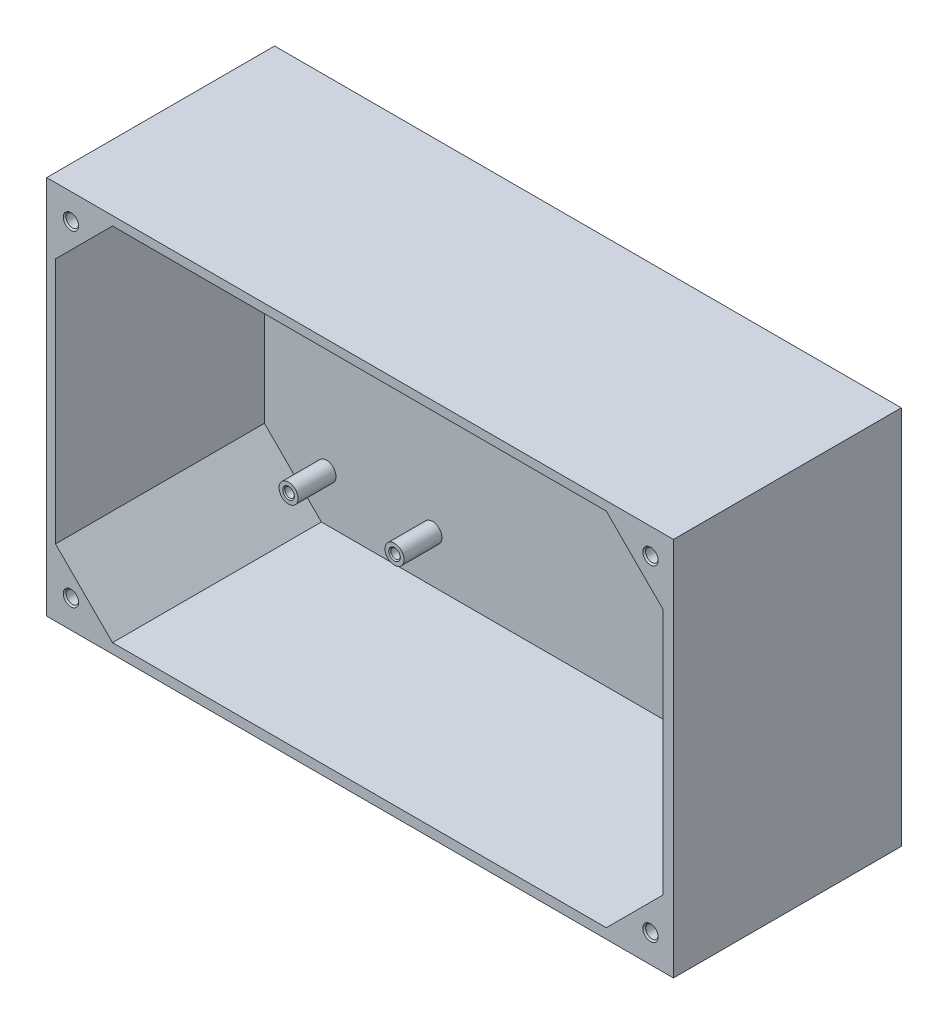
from build123d import *

# Parameters (mm, degrees)
SKIZZE2_W                       = 165
SKIZZE2_H                       = 100
AUFSATZ_LINEAR_AUSTRAGEN1_DEPTH = 60
SKIZZE3_W                       = 160
SKIZZE3_H                       = 95
SCHNITT_LINEAR_AUSTRAGEN1_DEPTH = 55
SKIZZE4_R                       = 2.5
AUFSATZ_LINEAR_AUSTRAGEN2_DEPTH = 10
M3_GEWINDEBOHRUNG1_D            = 2.5
M3_GEWINDEBOHRUNG1_DEPTH        = 10
M3_GEWINDEBOHRUNG1_CSINK_D      = 3.05
M3_GEWINDEBOHRUNG1_CSINK_ANGLE  = 90
M3_GEWINDEBOHRUNG1_TIP          = 0.751075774
SKIZZE12_W                      = 19.2
SKIZZE12_H                      = 15.6
AUFSATZ_LINEAR_AUSTRAGEN4_DEPTH = 20
SKIZZE13_W                      = 18.043363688
SKIZZE13_H                      = 14.504624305
SCHNITT_LINEAR_AUSTRAGEN5_DEPTH = 17
SKIZZE14_W                      = 3.084238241
SKIZZE14_H                      = 13.656016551
SCHNITT_LINEAR_AUSTRAGEN6_DEPTH = 18
VERRUNDUNG2_SIZE                = 15
FASE1_SIZE                      = 15
M4_GEWINDEBOHRUNG1_D            = 3.3
M4_GEWINDEBOHRUNG1_DEPTH        = 55
M4_GEWINDEBOHRUNG1_CSINK_D      = 4.05
M4_GEWINDEBOHRUNG1_CSINK_ANGLE  = 90
M4_GEWINDEBOHRUNG1_TIP          = 0.991420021


with BuildPart() as part:
    # Skizze2 → Aufsatz-Linear austragen1 (new body)
    with BuildSketch(Plane.XY):
        with Locations((16.551777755, 3.380437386)):
            Rectangle(SKIZZE2_W, SKIZZE2_H)
    extrude(amount=AUFSATZ_LINEAR_AUSTRAGEN1_DEPTH)

    # Skizze3 → Schnitt-Linear austragen1 (cut)
    with BuildSketch(Plane.XY.offset(60)):
        with Locations((16.376243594, 3.509491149)):
            Rectangle(SKIZZE3_W, SKIZZE3_H)
    extrude(amount=-SCHNITT_LINEAR_AUSTRAGEN1_DEPTH, mode=Mode.SUBTRACT)

    # Skizze4 → Aufsatz-Linear austragen2 (add)
    with BuildSketch(Plane.XY.offset(5)):
        with Locations(Location((-47.276594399, -31.71846572, 0), (0, 0, 180))):
            Circle(SKIZZE4_R)
        with Locations(Location((-51.808303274, 19.08153428, 0), (0, 0, 180))):
            Circle(SKIZZE4_R)
        with Locations(Location((-3.608303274, 19.08153428, 0), (0, 0, 180))):
            Circle(SKIZZE4_R)
        with Locations(Location((-19.376594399, -31.71846572, 0), (0, 0, 180))):
            Circle(SKIZZE4_R)
    extrude(amount=AUFSATZ_LINEAR_AUSTRAGEN2_DEPTH)

    # M3 Gewindebohrung1
    with Locations(Plane.XY.offset(15)):
        with Locations((-51.808303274, 19.08153428), (-3.608303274, 19.08153428), (-19.376594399, -31.71846572), (-47.276594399, -31.71846572)):
            CounterSinkHole(M3_GEWINDEBOHRUNG1_D / 2, M3_GEWINDEBOHRUNG1_CSINK_D / 2, depth=M3_GEWINDEBOHRUNG1_DEPTH, counter_sink_angle=M3_GEWINDEBOHRUNG1_CSINK_ANGLE)
            with Locations((0, 0, -(M3_GEWINDEBOHRUNG1_DEPTH + M3_GEWINDEBOHRUNG1_TIP / 2))):  # 118° drill point
                Cone(0, M3_GEWINDEBOHRUNG1_D / 2, M3_GEWINDEBOHRUNG1_TIP, mode=Mode.SUBTRACT)

    # Skizze12 → Aufsatz-Linear austragen4 (add)
    with BuildSketch(Plane.XY.offset(5)):
        with Locations((86.776243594, 7.18559596)):
            Rectangle(SKIZZE12_W, SKIZZE12_H)
    extrude(amount=AUFSATZ_LINEAR_AUSTRAGEN4_DEPTH)

    # Skizze13 → Schnitt-Linear austragen5 (cut)
    with BuildSketch(Plane.XY.offset(25)):
        with Locations((86.755806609, 7.252312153)):
            Rectangle(SKIZZE13_W, SKIZZE13_H)
    extrude(amount=-SCHNITT_LINEAR_AUSTRAGEN5_DEPTH, mode=Mode.SUBTRACT)

    # Skizze14 → Schnitt-Linear austragen6 (cut)
    with BuildSketch(Plane.ZY.offset(-77.176243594)):
        with Locations((7.296068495, 7.224868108)):
            Rectangle(SKIZZE14_W, SKIZZE14_H)
    extrude(amount=-SCHNITT_LINEAR_AUSTRAGEN6_DEPTH, mode=Mode.SUBTRACT)

    # Verrundung2
    verrundung2_edges = [part.edges().sort_by_distance(p)[0] for p in [
        (-63.623756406, 51.009491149, 32.5),
    ]]
    chamfer(verrundung2_edges, length=VERRUNDUNG2_SIZE)

    # Fase1
    fase1_edges = [part.edges().sort_by_distance(p)[0] for p in [
        (96.376243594, -43.990508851, 32.5),
        (-63.623756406, -43.990508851, 32.5),
        (96.376243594, 51.009491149, 32.5),
    ]]
    chamfer(fase1_edges, length=FASE1_SIZE)

    # M4 Gewindebohrung1
    with Locations(Plane.XY.offset(60)):
        with Locations((-59.564409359, 46.558453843), (93.009293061, 46.558453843), (93.009293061, -39.28558678), (-59.564409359, -39.28558678)):
            CounterSinkHole(M4_GEWINDEBOHRUNG1_D / 2, M4_GEWINDEBOHRUNG1_CSINK_D / 2, depth=M4_GEWINDEBOHRUNG1_DEPTH, counter_sink_angle=M4_GEWINDEBOHRUNG1_CSINK_ANGLE)
            with Locations((0, 0, -(M4_GEWINDEBOHRUNG1_DEPTH + M4_GEWINDEBOHRUNG1_TIP / 2))):  # 118° drill point
                Cone(0, M4_GEWINDEBOHRUNG1_D / 2, M4_GEWINDEBOHRUNG1_TIP, mode=Mode.SUBTRACT)


solid = part.part
